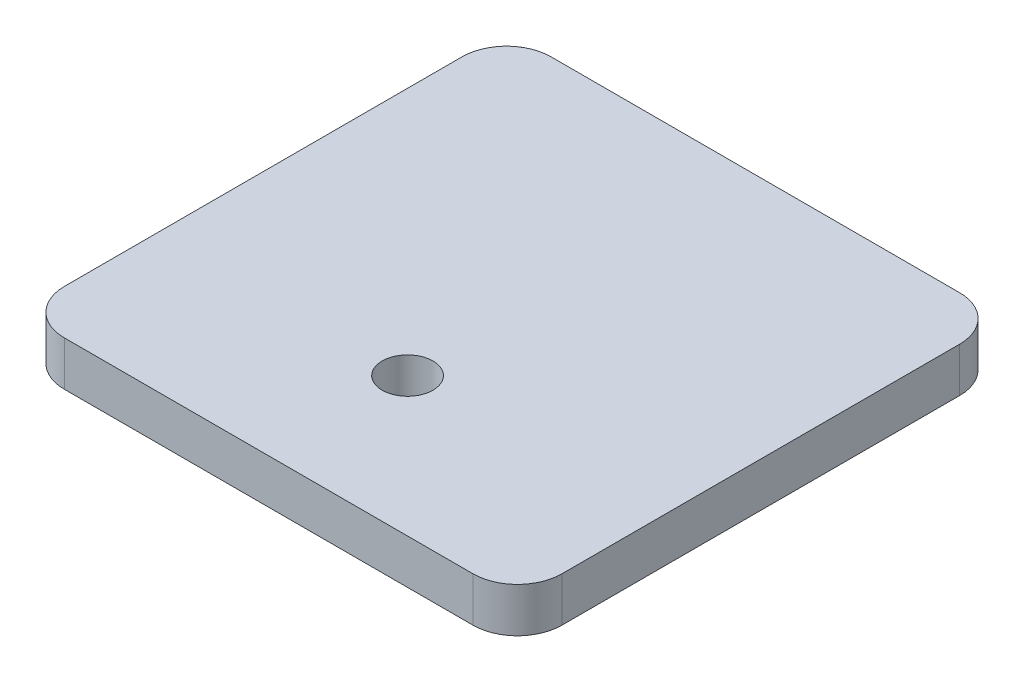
from build123d import *

# Parameters (mm, degrees)
ESQUISSE1_R             = 5.7
EXTRUSION1_DEPTH        = 10
ESQUISSE2_R             = 1.1
ENL_V_MAT_EXTRU_1_DEPTH = 3
ESQUISSE3_R             = 4
ENL_V_MAT_EXTRU_2_DEPTH = 8.2


with BuildPart() as part:
    # Esquisse1 → Extrusion1 (new body)
    with BuildSketch(Plane(origin=(0, 0, 0), x_dir=(1, 0, 0), z_dir=(0, 1, 0))):
        with BuildLine():
            Line((10, 0), (101.75, 0))
            ThreePointArc((101.75, 0), (108.821067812, 2.928932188), (111.75, 10))
            Line((111.75, 10), (111.75, 99.3))
            ThreePointArc((111.75, 99.3), (108.821067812, 106.371067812), (101.75, 109.3))
            Line((101.75, 109.3), (10, 109.3))
            ThreePointArc((10, 109.3), (2.928932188, 106.371067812), (0, 99.3))
            Line((0, 99.3), (0, 10))
            ThreePointArc((0, 10), (2.928932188, 2.928932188), (10, 0))
        make_face()
        with Locations(Location((55.875, 31.2, 0), (0, 0, 270))):
            Circle(ESQUISSE1_R, mode=Mode.SUBTRACT)
    extrude(amount=EXTRUSION1_DEPTH)

    # Esquisse2 → Enl_v. mat.-Extru.1 (cut)
    with BuildSketch(Plane.XZ):
        with Locations(Location((66.93863961, -36.743962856, 0), (0, 0, 270))):
            Circle(ESQUISSE2_R)
        with Locations(Location((44.93863961, -36.743962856, 0), (0, 0, 90))):
            Circle(ESQUISSE2_R)
        with Locations(Location((44.93863961, -82.743962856, 0), (0, 0, 270))):
            Circle(ESQUISSE2_R)
        with Locations(Location((66.93863961, -82.743962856, 0), (0, 0, 90))):
            Circle(ESQUISSE2_R)
        with BuildLine():
            Line((12.2627417, -96.2), (13.9372583, -96.2))
            ThreePointArc((13.9372583, -96.2), (16.2, -96.2), (16.2, -93.9372583))
            Line((16.2, -93.9372583), (16.2, -16.2))
            Line((16.2, -16.2), (95.55, -16.2))
            Line((95.55, -16.2), (95.55, -40.3872583))
            ThreePointArc((95.55, -40.3872583), (95.55, -42.65), (97.8127417, -42.65))
            Line((97.8127417, -42.65), (99.4872583, -42.65))
            ThreePointArc((99.4872583, -42.65), (101.75, -42.65), (101.75, -40.3872583))
            Line((101.75, -40.3872583), (101.75, -12.2627417))
            ThreePointArc((101.75, -12.2627417), (101.75, -10), (99.4872583, -10))
            Line((99.4872583, -10), (12.39002092, -10))
            ThreePointArc((12.39002092, -10), (10, -10), (10, -12.39002092))
            Line((10, -12.39002092), (10, -93.9372583))
            ThreePointArc((10, -93.9372583), (10, -96.2), (12.2627417, -96.2))
        make_face()
    extrude(amount=-ENL_V_MAT_EXTRU_1_DEPTH, mode=Mode.SUBTRACT)

    # Esquisse3 → Enl_v. mat.-Extru.2 (cut)
    with BuildSketch(Plane.XZ):
        with Locations(Location((55.875, -13.1, 0), (0, 0, 270))):
            Circle(ESQUISSE3_R)
        with Locations(Location((13.1, -56.2, 0), (0, 0, 270))):
            Circle(ESQUISSE3_R)
    extrude(amount=-ENL_V_MAT_EXTRU_2_DEPTH, mode=Mode.SUBTRACT)


solid = part.part
